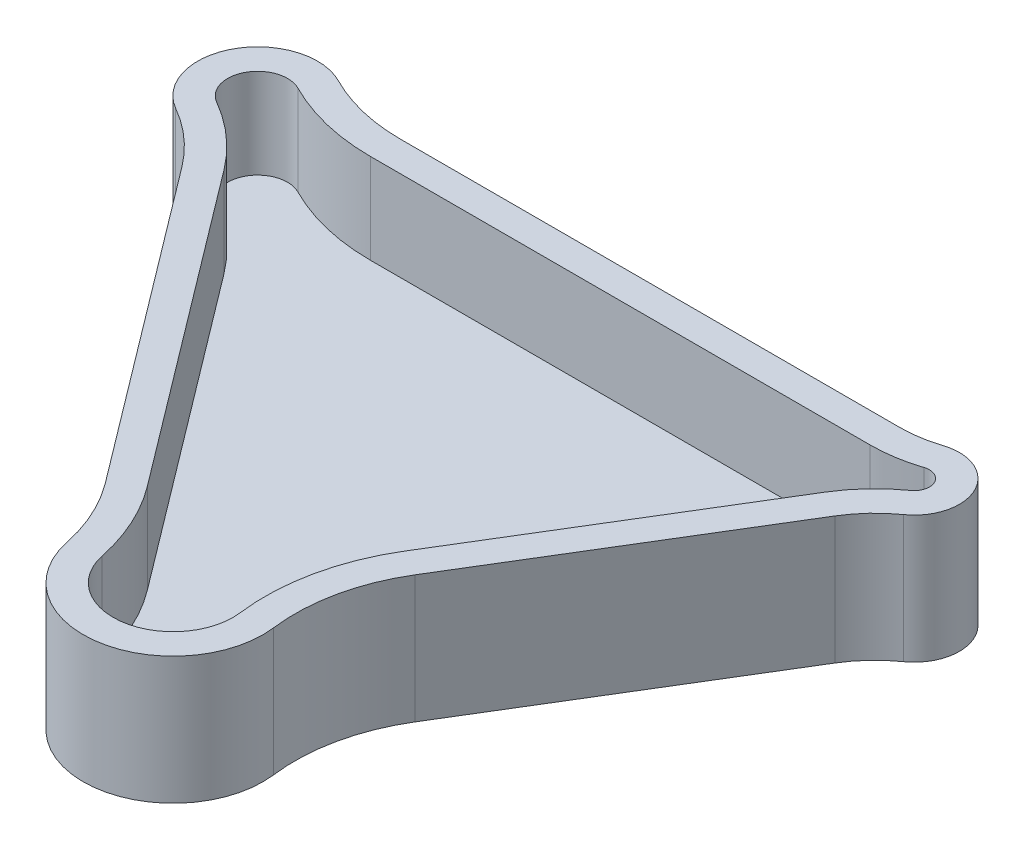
from build123d import *

# Parameters (mm, degrees)
EXTRUDE1_DEPTH      = 15.875
EXTRUDE_THIN1_DEPTH = 38.1


with BuildPart() as part:
    # Sketch1 → Extrude1 (new body)
    with BuildSketch(Plane(origin=(0, 0, 0), x_dir=(1, 0, 0), z_dir=(0, 1, 0))):
        with BuildLine():
            Line((-65.308297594, 128.097699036), (146.409023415, 128.097699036))
            ThreePointArc((146.409023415, 128.097699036), (154.398106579, 128.729835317), (162.188363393, 130.610512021))
            ThreePointArc((162.188363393, 130.610512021), (185.128828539, 121.053415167), (179.098460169, 96.944543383))
            ThreePointArc((179.098460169, 96.944543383), (171.290249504, 90.133801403), (165.026329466, 81.880458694))
            Line((165.026329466, 81.880458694), (97.6662129, -28.717499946))
            ThreePointArc((97.6662129, -28.717499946), (88.219565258, -52.471066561), (87.160282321, -78.01219023))
            ThreePointArc((87.160282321, -78.01219023), (55.715080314, -120.40857256), (12.086243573, -90.696982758))
            ThreePointArc((12.086243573, -90.696982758), (6.879436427, -74.845928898), (-1.652358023, -60.508033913))
            Line((-1.652358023, -60.508033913), (-101.411749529, 71.684891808))
            ThreePointArc((-101.411749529, 71.684891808), (-111.764911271, 82.872935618), (-124.137797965, 91.776415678))
            ThreePointArc((-124.137797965, 91.776415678), (-133.760316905, 125.893928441), (-99.905941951, 136.404820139))
            ThreePointArc((-99.905941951, 136.404820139), (-83.098781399, 130.203578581), (-65.308297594, 128.097699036))
        make_face()
    extrude(amount=EXTRUDE1_DEPTH)

    # Sketch3 → Extrude-Thin1 (add)
    with BuildSketch(Plane(origin=(0, 15.875, 0), x_dir=(-1, 0, 0), z_dir=(0, 1, 0))):
        with BuildLine():
            Line((-146.409023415, -128.097699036), (65.308297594, -128.097699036))
            ThreePointArc((65.308297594, -128.097699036), (83.098781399, -130.203578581), (99.905941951, -136.404820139))
            ThreePointArc((99.905941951, -136.404820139), (133.760316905, -125.893928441), (124.137797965, -91.776415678))
            ThreePointArc((124.137797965, -91.776415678), (111.764911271, -82.872935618), (101.411749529, -71.684891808))
            Line((101.411749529, -71.684891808), (1.652358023, 60.508033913))
            ThreePointArc((1.652358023, 60.508033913), (-6.879436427, 74.845928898), (-12.086243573, 90.696982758))
            ThreePointArc((-12.086243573, 90.696982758), (-55.715080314, 120.40857256), (-87.160282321, 78.01219023))
            ThreePointArc((-87.160282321, 78.01219023), (-88.219565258, 52.471066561), (-97.6662129, 28.717499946))
            Line((-97.6662129, 28.717499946), (-165.026329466, -81.880458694))
            ThreePointArc((-165.026329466, -81.880458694), (-171.290249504, -90.133801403), (-179.098460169, -96.944543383))
            ThreePointArc((-179.098460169, -96.944543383), (-185.128828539, -121.053415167), (-162.188363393, -130.610512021))
            ThreePointArc((-162.188363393, -130.610512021), (-154.398106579, -128.729835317), (-146.409023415, -128.097699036))
        make_face()
        with BuildLine():
            Line((-146.409023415, -115.397699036), (65.308297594, -115.397699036))
            ThreePointArc((65.308297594, -115.397699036), (86.063862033, -117.854558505), (105.67221601, -125.089340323))
            ThreePointArc((105.67221601, -125.089340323), (122.599403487, -119.833894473), (117.788144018, -102.775138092))
            ThreePointArc((117.788144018, -102.775138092), (103.353109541, -92.387744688), (91.274420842, -79.335026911))
            Line((91.274420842, -79.335026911), (-8.484970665, 52.85789881))
            ThreePointArc((-8.484970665, 52.85789881), (-18.438730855, 69.58544296), (-24.513339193, 88.07833913))
            ThreePointArc((-24.513339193, 88.07833913), (-53.599230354, 107.886065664), (-74.562698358, 79.621810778))
            ThreePointArc((-74.562698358, 79.621810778), (-75.798528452, 49.823833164), (-86.819617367, 22.11133878))
            Line((-86.819617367, 22.11133878), (-154.179733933, -88.48661986))
            ThreePointArc((-154.179733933, -88.48661986), (-162.009633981, -98.803298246), (-171.769897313, -107.316725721))
            ThreePointArc((-171.769897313, -107.316725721), (-173.780020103, -115.353016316), (-166.133198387, -118.538715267))
            ThreePointArc((-166.133198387, -118.538715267), (-156.39537737, -116.187869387), (-146.409023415, -115.397699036))
        make_face(mode=Mode.SUBTRACT)
    extrude(amount=EXTRUDE_THIN1_DEPTH)


solid = part.part
